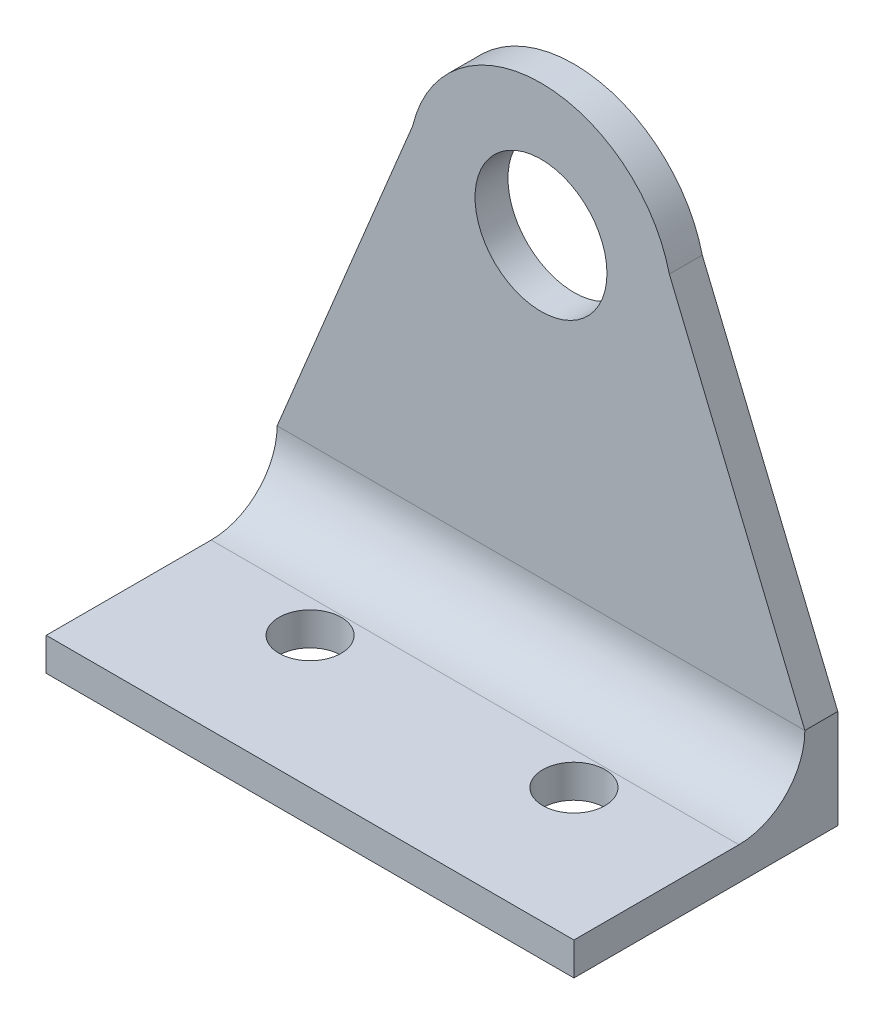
ISO-10303-21;
HEADER;
FILE_DESCRIPTION(('STEP AP214'),'2;1');
FILE_NAME('part.step','',(''),(''),'','','');
FILE_SCHEMA(('AUTOMOTIVE_DESIGN { 1 0 10303 214 1 1 1 1 }'));
ENDSEC;
DATA;
#1=APPLICATION_CONTEXT('core data for automotive mechanical design processes');
#2=APPLICATION_PROTOCOL_DEFINITION('international standard','automotive_design',2000,#1);
#3=PRODUCT_CONTEXT('',#1,'mechanical');
#4=PRODUCT('Part','Part','',(#3));
#5=PRODUCT_RELATED_PRODUCT_CATEGORY('part','',(#4));
#6=PRODUCT_DEFINITION_FORMATION('','',#4);
#7=PRODUCT_DEFINITION_CONTEXT('part definition',#1,'design');
#8=PRODUCT_DEFINITION('design','',#6,#7);
#9=PRODUCT_DEFINITION_SHAPE('','',#8);
#10=(LENGTH_UNIT() NAMED_UNIT(*) SI_UNIT(.MILLI.,.METRE.));
#11=(NAMED_UNIT(*) PLANE_ANGLE_UNIT() SI_UNIT($,.RADIAN.));
#12=(NAMED_UNIT(*) SI_UNIT($,.STERADIAN.) SOLID_ANGLE_UNIT());
#13=UNCERTAINTY_MEASURE_WITH_UNIT(LENGTH_MEASURE(1.E-05),#10,'distance_accuracy_value','');
#14=(GEOMETRIC_REPRESENTATION_CONTEXT(3) GLOBAL_UNCERTAINTY_ASSIGNED_CONTEXT((#13)) GLOBAL_UNIT_ASSIGNED_CONTEXT((#10,
#11,#12)) REPRESENTATION_CONTEXT('',''));
#15=CARTESIAN_POINT('',(0.,0.,0.));
#16=DIRECTION('',(0.,0.,1.));
#17=DIRECTION('',(1.,0.,0.));
#18=AXIS2_PLACEMENT_3D('',#15,#16,#17);
#19=CARTESIAN_POINT('',(25.4,0.,-25.4));
#20=DIRECTION('',(0.,0.,1.));
#21=DIRECTION('',(1.,0.,0.));
#22=AXIS2_PLACEMENT_3D('',#19,#20,#21);
#23=PLANE('',#22);
#24=CARTESIAN_POINT('',(0.,38.1,-25.4));
#25=DIRECTION('',(0.,0.,1.));
#26=DIRECTION('',(1.,0.,0.));
#27=AXIS2_PLACEMENT_3D('',#24,#25,#26);
#28=CIRCLE('',#27,6.35);
#29=CARTESIAN_POINT('',(6.35,38.1,-25.4));
#30=VERTEX_POINT('',#29);
#31=EDGE_CURVE('E209',#30,#30,#28,.T.);
#32=ORIENTED_EDGE('',*,*,#31,.T.);
#33=EDGE_LOOP('',(#32));
#34=FACE_BOUND('',#33,.T.);
#35=CARTESIAN_POINT('',(0.,38.1,-25.4));
#36=DIRECTION('',(0.,0.,1.));
#37=DIRECTION('',(1.,0.,0.));
#38=AXIS2_PLACEMENT_3D('',#35,#36,#37);
#39=CIRCLE('',#38,12.7);
#40=CARTESIAN_POINT('',(12.3546091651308,41.0417056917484,-25.4));
#41=VERTEX_POINT('',#40);
#42=CARTESIAN_POINT('',(-12.3546091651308,41.0417056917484,-25.4));
#43=VERTEX_POINT('',#42);
#44=EDGE_CURVE('E219',#41,#43,#39,.T.);
#45=ORIENTED_EDGE('',*,*,#44,.F.);
#46=DIRECTION('',(-0.382400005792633,0.92399688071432,0.));
#47=VECTOR('',#46,1.);
#48=CARTESIAN_POINT('',(32.4326226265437,-7.47299495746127,-25.4));
#49=LINE('',#48,#47);
#50=CARTESIAN_POINT('',(25.4,9.52,-25.4));
#51=VERTEX_POINT('',#50);
#52=EDGE_CURVE('E138',#51,#41,#49,.T.);
#53=ORIENTED_EDGE('',*,*,#52,.F.);
#54=DIRECTION('',(0.,1.,0.));
#55=VECTOR('',#54,1.);
#56=CARTESIAN_POINT('',(25.4,0.,-25.4));
#57=LINE('',#56,#55);
#58=CARTESIAN_POINT('',(25.4,0.,-25.4));
#59=VERTEX_POINT('',#58);
#60=EDGE_CURVE('E137',#59,#51,#57,.T.);
#61=ORIENTED_EDGE('',*,*,#60,.F.);
#62=DIRECTION('',(-1.,0.,0.));
#63=VECTOR('',#62,1.);
#64=CARTESIAN_POINT('',(25.4,0.,-25.4));
#65=LINE('',#64,#63);
#66=CARTESIAN_POINT('',(-25.4,0.,-25.4));
#67=VERTEX_POINT('',#66);
#68=EDGE_CURVE('E157',#59,#67,#65,.T.);
#69=ORIENTED_EDGE('',*,*,#68,.T.);
#70=DIRECTION('',(0.,1.,0.));
#71=VECTOR('',#70,1.);
#72=CARTESIAN_POINT('',(-25.4,0.,-25.4));
#73=LINE('',#72,#71);
#74=CARTESIAN_POINT('',(-25.4,9.52,-25.4));
#75=VERTEX_POINT('',#74);
#76=EDGE_CURVE('E172',#67,#75,#73,.T.);
#77=ORIENTED_EDGE('',*,*,#76,.T.);
#78=DIRECTION('',(0.382400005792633,0.92399688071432,0.));
#79=VECTOR('',#78,1.);
#80=CARTESIAN_POINT('',(-32.4326226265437,-7.47299495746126,-25.4));
#81=LINE('',#80,#79);
#82=EDGE_CURVE('E73',#75,#43,#81,.T.);
#83=ORIENTED_EDGE('',*,*,#82,.T.);
#84=EDGE_LOOP('',(#45,#53,#61,#69,#77,#83));
#85=FACE_BOUND('',#84,.T.);
#86=ADVANCED_FACE('F58',(#34,#85),#23,.F.);
#87=CARTESIAN_POINT('',(25.4,3.17,-22.23));
#88=DIRECTION('',(0.,0.,-1.));
#89=DIRECTION('',(-1.,0.,0.));
#90=AXIS2_PLACEMENT_3D('',#87,#88,#89);
#91=PLANE('',#90);
#92=CARTESIAN_POINT('',(0.,38.1,-22.23));
#93=DIRECTION('',(0.,0.,1.));
#94=DIRECTION('',(1.,0.,0.));
#95=AXIS2_PLACEMENT_3D('',#92,#93,#94);
#96=CIRCLE('',#95,6.35);
#97=CARTESIAN_POINT('',(6.35,38.1,-22.23));
#98=VERTEX_POINT('',#97);
#99=EDGE_CURVE('E210',#98,#98,#96,.T.);
#100=ORIENTED_EDGE('',*,*,#99,.F.);
#101=EDGE_LOOP('',(#100));
#102=FACE_BOUND('',#101,.T.);
#103=DIRECTION('',(-0.382400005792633,0.92399688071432,0.));
#104=VECTOR('',#103,1.);
#105=CARTESIAN_POINT('',(32.4326226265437,-7.47299495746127,-22.23));
#106=LINE('',#105,#104);
#107=CARTESIAN_POINT('',(25.4,9.52,-22.23));
#108=VERTEX_POINT('',#107);
#109=CARTESIAN_POINT('',(12.3546091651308,41.0417056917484,-22.23));
#110=VERTEX_POINT('',#109);
#111=EDGE_CURVE('E123',#108,#110,#106,.T.);
#112=ORIENTED_EDGE('',*,*,#111,.T.);
#113=CARTESIAN_POINT('',(0.,38.1,-22.23));
#114=DIRECTION('',(0.,0.,1.));
#115=DIRECTION('',(1.,0.,0.));
#116=AXIS2_PLACEMENT_3D('',#113,#114,#115);
#117=CIRCLE('',#116,12.7);
#118=CARTESIAN_POINT('',(-12.3546091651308,41.0417056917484,-22.23));
#119=VERTEX_POINT('',#118);
#120=EDGE_CURVE('E220',#110,#119,#117,.T.);
#121=ORIENTED_EDGE('',*,*,#120,.T.);
#122=DIRECTION('',(0.382400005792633,0.92399688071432,0.));
#123=VECTOR('',#122,1.);
#124=CARTESIAN_POINT('',(-32.4326226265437,-7.47299495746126,-22.23));
#125=LINE('',#124,#123);
#126=CARTESIAN_POINT('',(-25.4,9.52,-22.23));
#127=VERTEX_POINT('',#126);
#128=EDGE_CURVE('E145',#127,#119,#125,.T.);
#129=ORIENTED_EDGE('',*,*,#128,.F.);
#130=DIRECTION('',(-1.,0.,0.));
#131=VECTOR('',#130,1.);
#132=CARTESIAN_POINT('',(25.4,9.52,-22.23));
#133=LINE('',#132,#131);
#134=EDGE_CURVE('E142',#127,#108,#133,.F.);
#135=ORIENTED_EDGE('',*,*,#134,.T.);
#136=EDGE_LOOP('',(#112,#121,#129,#135));
#137=FACE_BOUND('',#136,.T.);
#138=ADVANCED_FACE('F143',(#102,#137),#91,.F.);
#139=CARTESIAN_POINT('',(25.4,0.,0.));
#140=DIRECTION('',(1.,0.,0.));
#141=DIRECTION('',(0.,0.,-1.));
#142=AXIS2_PLACEMENT_3D('',#139,#140,#141);
#143=PLANE('',#142);
#144=ORIENTED_EDGE('',*,*,#60,.T.);
#145=DIRECTION('',(0.,0.,1.));
#146=VECTOR('',#145,1.);
#147=CARTESIAN_POINT('',(25.4,9.52,-25.4));
#148=LINE('',#147,#146);
#149=EDGE_CURVE('E126',#51,#108,#148,.T.);
#150=ORIENTED_EDGE('',*,*,#149,.T.);
#151=CARTESIAN_POINT('',(25.4,9.52,-15.88));
#152=DIRECTION('',(1.,0.,0.));
#153=DIRECTION('',(0.,0.,-1.));
#154=AXIS2_PLACEMENT_3D('',#151,#152,#153);
#155=CIRCLE('',#154,6.35);
#156=CARTESIAN_POINT('',(25.4,3.17,-15.88));
#157=VERTEX_POINT('',#156);
#158=EDGE_CURVE('E12',#108,#157,#155,.F.);
#159=ORIENTED_EDGE('',*,*,#158,.T.);
#160=DIRECTION('',(0.,0.,1.));
#161=VECTOR('',#160,1.);
#162=CARTESIAN_POINT('',(25.4,3.17,0.));
#163=LINE('',#162,#161);
#164=CARTESIAN_POINT('',(25.4,3.17,0.));
#165=VERTEX_POINT('',#164);
#166=EDGE_CURVE('E182',#157,#165,#163,.T.);
#167=ORIENTED_EDGE('',*,*,#166,.T.);
#168=DIRECTION('',(0.,-1.,0.));
#169=VECTOR('',#168,1.);
#170=CARTESIAN_POINT('',(25.4,3.17,0.));
#171=LINE('',#170,#169);
#172=CARTESIAN_POINT('',(25.4,0.,0.));
#173=VERTEX_POINT('',#172);
#174=EDGE_CURVE('E171',#165,#173,#171,.T.);
#175=ORIENTED_EDGE('',*,*,#174,.T.);
#176=DIRECTION('',(0.,0.,-1.));
#177=VECTOR('',#176,1.);
#178=CARTESIAN_POINT('',(25.4,0.,0.));
#179=LINE('',#178,#177);
#180=EDGE_CURVE('E175',#173,#59,#179,.T.);
#181=ORIENTED_EDGE('',*,*,#180,.T.);
#182=EDGE_LOOP('',(#144,#150,#159,#167,#175,#181));
#183=FACE_BOUND('',#182,.T.);
#184=ADVANCED_FACE('F135',(#183),#143,.T.);
#185=CARTESIAN_POINT('',(25.4,3.17,0.));
#186=DIRECTION('',(0.,0.,-1.));
#187=DIRECTION('',(-1.,0.,0.));
#188=AXIS2_PLACEMENT_3D('',#185,#186,#187);
#189=PLANE('',#188);
#190=DIRECTION('',(0.,-1.,0.));
#191=VECTOR('',#190,1.);
#192=CARTESIAN_POINT('',(-25.4,3.17,0.));
#193=LINE('',#192,#191);
#194=CARTESIAN_POINT('',(-25.4,3.17,0.));
#195=VERTEX_POINT('',#194);
#196=CARTESIAN_POINT('',(-25.4,0.,0.));
#197=VERTEX_POINT('',#196);
#198=EDGE_CURVE('E168',#195,#197,#193,.T.);
#199=ORIENTED_EDGE('',*,*,#198,.T.);
#200=DIRECTION('',(-1.,0.,0.));
#201=VECTOR('',#200,1.);
#202=CARTESIAN_POINT('',(25.4,0.,0.));
#203=LINE('',#202,#201);
#204=EDGE_CURVE('E154',#173,#197,#203,.T.);
#205=ORIENTED_EDGE('',*,*,#204,.F.);
#206=ORIENTED_EDGE('',*,*,#174,.F.);
#207=DIRECTION('',(-1.,0.,0.));
#208=VECTOR('',#207,1.);
#209=CARTESIAN_POINT('',(25.4,3.17,0.));
#210=LINE('',#209,#208);
#211=EDGE_CURVE('E181',#165,#195,#210,.T.);
#212=ORIENTED_EDGE('',*,*,#211,.T.);
#213=EDGE_LOOP('',(#199,#205,#206,#212));
#214=FACE_BOUND('',#213,.T.);
#215=ADVANCED_FACE('F191',(#214),#189,.F.);
#216=CARTESIAN_POINT('',(25.4,0.,0.));
#217=DIRECTION('',(0.,1.,0.));
#218=DIRECTION('',(0.,0.,1.));
#219=AXIS2_PLACEMENT_3D('',#216,#217,#218);
#220=PLANE('',#219);
#221=CARTESIAN_POINT('',(-12.7,0.,-12.7));
#222=DIRECTION('',(0.,1.,0.));
#223=DIRECTION('',(0.,0.,1.));
#224=AXIS2_PLACEMENT_3D('',#221,#222,#223);
#225=CIRCLE('',#224,3.);
#226=CARTESIAN_POINT('',(-12.7,0.,-9.7));
#227=VERTEX_POINT('',#226);
#228=EDGE_CURVE('E203',#227,#227,#225,.T.);
#229=ORIENTED_EDGE('',*,*,#228,.T.);
#230=EDGE_LOOP('',(#229));
#231=FACE_BOUND('',#230,.T.);
#232=CARTESIAN_POINT('',(12.7,0.,-12.7));
#233=DIRECTION('',(0.,1.,0.));
#234=DIRECTION('',(0.,0.,1.));
#235=AXIS2_PLACEMENT_3D('',#232,#233,#234);
#236=CIRCLE('',#235,3.);
#237=CARTESIAN_POINT('',(12.7,0.,-9.7));
#238=VERTEX_POINT('',#237);
#239=EDGE_CURVE('E192',#238,#238,#236,.T.);
#240=ORIENTED_EDGE('',*,*,#239,.T.);
#241=EDGE_LOOP('',(#240));
#242=FACE_BOUND('',#241,.T.);
#243=DIRECTION('',(0.,0.,-1.));
#244=VECTOR('',#243,1.);
#245=CARTESIAN_POINT('',(-25.4,0.,0.));
#246=LINE('',#245,#244);
#247=EDGE_CURVE('E177',#197,#67,#246,.T.);
#248=ORIENTED_EDGE('',*,*,#247,.T.);
#249=ORIENTED_EDGE('',*,*,#68,.F.);
#250=ORIENTED_EDGE('',*,*,#180,.F.);
#251=ORIENTED_EDGE('',*,*,#204,.T.);
#252=EDGE_LOOP('',(#248,#249,#250,#251));
#253=FACE_BOUND('',#252,.T.);
#254=ADVANCED_FACE('F188',(#231,#242,#253),#220,.F.);
#255=CARTESIAN_POINT('',(25.4,3.17,0.));
#256=DIRECTION('',(0.,-1.,0.));
#257=DIRECTION('',(0.,0.,-1.));
#258=AXIS2_PLACEMENT_3D('',#255,#256,#257);
#259=PLANE('',#258);
#260=CARTESIAN_POINT('',(-12.7,3.17,-12.7));
#261=DIRECTION('',(0.,1.,0.));
#262=DIRECTION('',(0.,0.,1.));
#263=AXIS2_PLACEMENT_3D('',#260,#261,#262);
#264=CIRCLE('',#263,2.99999999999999);
#265=CARTESIAN_POINT('',(-12.7,3.17,-9.70000000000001));
#266=VERTEX_POINT('',#265);
#267=EDGE_CURVE('E206',#266,#266,#264,.T.);
#268=ORIENTED_EDGE('',*,*,#267,.F.);
#269=EDGE_LOOP('',(#268));
#270=FACE_BOUND('',#269,.T.);
#271=CARTESIAN_POINT('',(12.7,3.17,-12.7));
#272=DIRECTION('',(0.,1.,0.));
#273=DIRECTION('',(0.,0.,1.));
#274=AXIS2_PLACEMENT_3D('',#271,#272,#273);
#275=CIRCLE('',#274,2.99999999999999);
#276=CARTESIAN_POINT('',(12.7,3.17,-9.70000000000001));
#277=VERTEX_POINT('',#276);
#278=EDGE_CURVE('E195',#277,#277,#275,.T.);
#279=ORIENTED_EDGE('',*,*,#278,.F.);
#280=EDGE_LOOP('',(#279));
#281=FACE_BOUND('',#280,.T.);
#282=ORIENTED_EDGE('',*,*,#166,.F.);
#283=DIRECTION('',(-1.,0.,0.));
#284=VECTOR('',#283,1.);
#285=CARTESIAN_POINT('',(-25.4,3.17,-15.88));
#286=LINE('',#285,#284);
#287=CARTESIAN_POINT('',(-25.4,3.17,-15.88));
#288=VERTEX_POINT('',#287);
#289=EDGE_CURVE('E148',#157,#288,#286,.T.);
#290=ORIENTED_EDGE('',*,*,#289,.T.);
#291=DIRECTION('',(0.,0.,1.));
#292=VECTOR('',#291,1.);
#293=CARTESIAN_POINT('',(-25.4,3.17,0.));
#294=LINE('',#293,#292);
#295=EDGE_CURVE('E166',#288,#195,#294,.T.);
#296=ORIENTED_EDGE('',*,*,#295,.T.);
#297=ORIENTED_EDGE('',*,*,#211,.F.);
#298=EDGE_LOOP('',(#282,#290,#296,#297));
#299=FACE_BOUND('',#298,.T.);
#300=ADVANCED_FACE('F248',(#270,#281,#299),#259,.F.);
#301=CARTESIAN_POINT('',(-25.4,0.,0.));
#302=DIRECTION('',(1.,0.,0.));
#303=DIRECTION('',(0.,0.,-1.));
#304=AXIS2_PLACEMENT_3D('',#301,#302,#303);
#305=PLANE('',#304);
#306=CARTESIAN_POINT('',(-25.4,9.52,-15.88));
#307=DIRECTION('',(1.,0.,0.));
#308=DIRECTION('',(0.,0.,-1.));
#309=AXIS2_PLACEMENT_3D('',#306,#307,#308);
#310=CIRCLE('',#309,6.35);
#311=EDGE_CURVE('E66',#288,#127,#310,.T.);
#312=ORIENTED_EDGE('',*,*,#311,.T.);
#313=DIRECTION('',(0.,0.,1.));
#314=VECTOR('',#313,1.);
#315=CARTESIAN_POINT('',(-25.4,9.52,-25.4));
#316=LINE('',#315,#314);
#317=EDGE_CURVE('E163',#75,#127,#316,.T.);
#318=ORIENTED_EDGE('',*,*,#317,.F.);
#319=ORIENTED_EDGE('',*,*,#76,.F.);
#320=ORIENTED_EDGE('',*,*,#247,.F.);
#321=ORIENTED_EDGE('',*,*,#198,.F.);
#322=ORIENTED_EDGE('',*,*,#295,.F.);
#323=EDGE_LOOP('',(#312,#318,#319,#320,#321,#322));
#324=FACE_BOUND('',#323,.T.);
#325=ADVANCED_FACE('F161',(#324),#305,.F.);
#326=CARTESIAN_POINT('',(25.4,9.52,-15.88));
#327=DIRECTION('',(1.,0.,0.));
#328=DIRECTION('',(0.,0.,-1.));
#329=AXIS2_PLACEMENT_3D('',#326,#327,#328);
#330=CYLINDRICAL_SURFACE('',#329,6.35);
#331=ORIENTED_EDGE('',*,*,#158,.F.);
#332=ORIENTED_EDGE('',*,*,#134,.F.);
#333=ORIENTED_EDGE('',*,*,#311,.F.);
#334=ORIENTED_EDGE('',*,*,#289,.F.);
#335=EDGE_LOOP('',(#331,#332,#333,#334));
#336=FACE_BOUND('',#335,.T.);
#337=ADVANCED_FACE('F60',(#336),#330,.F.);
#338=CARTESIAN_POINT('',(12.7,3.17,-12.7));
#339=DIRECTION('',(0.,1.,0.));
#340=DIRECTION('',(0.,0.,1.));
#341=AXIS2_PLACEMENT_3D('',#338,#339,#340);
#342=CYLINDRICAL_SURFACE('',#341,2.99999999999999);
#343=ORIENTED_EDGE('',*,*,#239,.F.);
#344=EDGE_LOOP('',(#343));
#345=FACE_BOUND('',#344,.T.);
#346=ORIENTED_EDGE('',*,*,#278,.T.);
#347=EDGE_LOOP('',(#346));
#348=FACE_BOUND('',#347,.T.);
#349=ADVANCED_FACE('F259',(#345,#348),#342,.F.);
#350=CARTESIAN_POINT('',(-12.7,3.17,-12.7));
#351=DIRECTION('',(0.,1.,0.));
#352=DIRECTION('',(0.,0.,1.));
#353=AXIS2_PLACEMENT_3D('',#350,#351,#352);
#354=CYLINDRICAL_SURFACE('',#353,2.99999999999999);
#355=ORIENTED_EDGE('',*,*,#228,.F.);
#356=EDGE_LOOP('',(#355));
#357=FACE_BOUND('',#356,.T.);
#358=ORIENTED_EDGE('',*,*,#267,.T.);
#359=EDGE_LOOP('',(#358));
#360=FACE_BOUND('',#359,.T.);
#361=ADVANCED_FACE('F271',(#357,#360),#354,.F.);
#362=CARTESIAN_POINT('',(0.,38.1,-25.4));
#363=DIRECTION('',(0.,0.,1.));
#364=DIRECTION('',(1.,0.,0.));
#365=AXIS2_PLACEMENT_3D('',#362,#363,#364);
#366=CYLINDRICAL_SURFACE('',#365,6.35);
#367=CARTESIAN_POINT('',(6.35,38.1,-25.4));
#368=CARTESIAN_POINT('',(6.35,38.1,-25.3669791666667));
#369=CARTESIAN_POINT('',(6.35,38.1,-25.3339583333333));
#370=CARTESIAN_POINT('',(6.35,38.1,-25.2679166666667));
#371=CARTESIAN_POINT('',(6.35,38.1,-25.2348958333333));
#372=CARTESIAN_POINT('',(6.35,38.1,-25.1688541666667));
#373=CARTESIAN_POINT('',(6.35,38.1,-25.1358333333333));
#374=CARTESIAN_POINT('',(6.35,38.1,-25.0697916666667));
#375=CARTESIAN_POINT('',(6.35,38.1,-25.0367708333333));
#376=CARTESIAN_POINT('',(6.35,38.1,-24.9707291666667));
#377=CARTESIAN_POINT('',(6.35,38.1,-24.9377083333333));
#378=CARTESIAN_POINT('',(6.35,38.1,-24.8716666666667));
#379=CARTESIAN_POINT('',(6.35,38.1,-24.8386458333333));
#380=CARTESIAN_POINT('',(6.35,38.1,-24.7726041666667));
#381=CARTESIAN_POINT('',(6.35,38.1,-24.7395833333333));
#382=CARTESIAN_POINT('',(6.35,38.1,-24.6735416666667));
#383=CARTESIAN_POINT('',(6.35,38.1,-24.6405208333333));
#384=CARTESIAN_POINT('',(6.35,38.1,-24.5744791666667));
#385=CARTESIAN_POINT('',(6.35,38.1,-24.5414583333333));
#386=CARTESIAN_POINT('',(6.35,38.1,-24.4754166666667));
#387=CARTESIAN_POINT('',(6.35,38.1,-24.4423958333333));
#388=CARTESIAN_POINT('',(6.35,38.1,-24.3763541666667));
#389=CARTESIAN_POINT('',(6.35,38.1,-24.3433333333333));
#390=CARTESIAN_POINT('',(6.35,38.1,-24.2772916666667));
#391=CARTESIAN_POINT('',(6.35,38.1,-24.2442708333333));
#392=CARTESIAN_POINT('',(6.35,38.1,-24.1782291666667));
#393=CARTESIAN_POINT('',(6.35,38.1,-24.1452083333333));
#394=CARTESIAN_POINT('',(6.35,38.1,-24.0791666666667));
#395=CARTESIAN_POINT('',(6.35,38.1,-24.0461458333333));
#396=CARTESIAN_POINT('',(6.35,38.1,-23.9801041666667));
#397=CARTESIAN_POINT('',(6.35,38.1,-23.9470833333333));
#398=CARTESIAN_POINT('',(6.35,38.1,-23.8810416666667));
#399=CARTESIAN_POINT('',(6.35,38.1,-23.8480208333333));
#400=CARTESIAN_POINT('',(6.35,38.1,-23.7819791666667));
#401=CARTESIAN_POINT('',(6.35,38.1,-23.7489583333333));
#402=CARTESIAN_POINT('',(6.35,38.1,-23.6829166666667));
#403=CARTESIAN_POINT('',(6.35,38.1,-23.6498958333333));
#404=CARTESIAN_POINT('',(6.35,38.1,-23.5838541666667));
#405=CARTESIAN_POINT('',(6.35,38.1,-23.5508333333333));
#406=CARTESIAN_POINT('',(6.35,38.1,-23.4847916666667));
#407=CARTESIAN_POINT('',(6.35,38.1,-23.4517708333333));
#408=CARTESIAN_POINT('',(6.35,38.1,-23.3857291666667));
#409=CARTESIAN_POINT('',(6.35,38.1,-23.3527083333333));
#410=CARTESIAN_POINT('',(6.35,38.1,-23.2866666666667));
#411=CARTESIAN_POINT('',(6.35,38.1,-23.2536458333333));
#412=CARTESIAN_POINT('',(6.35,38.1,-23.1876041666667));
#413=CARTESIAN_POINT('',(6.35,38.1,-23.1545833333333));
#414=CARTESIAN_POINT('',(6.35,38.1,-23.0885416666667));
#415=CARTESIAN_POINT('',(6.35,38.1,-23.0555208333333));
#416=CARTESIAN_POINT('',(6.35,38.1,-22.9894791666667));
#417=CARTESIAN_POINT('',(6.35,38.1,-22.9564583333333));
#418=CARTESIAN_POINT('',(6.35,38.1,-22.8904166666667));
#419=CARTESIAN_POINT('',(6.35,38.1,-22.8573958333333));
#420=CARTESIAN_POINT('',(6.35,38.1,-22.7913541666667));
#421=CARTESIAN_POINT('',(6.35,38.1,-22.7583333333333));
#422=CARTESIAN_POINT('',(6.35,38.1,-22.6922916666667));
#423=CARTESIAN_POINT('',(6.35,38.1,-22.6592708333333));
#424=CARTESIAN_POINT('',(6.35,38.1,-22.5932291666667));
#425=CARTESIAN_POINT('',(6.35,38.1,-22.5602083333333));
#426=CARTESIAN_POINT('',(6.35,38.1,-22.4941666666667));
#427=CARTESIAN_POINT('',(6.35,38.1,-22.4611458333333));
#428=CARTESIAN_POINT('',(6.35,38.1,-22.3951041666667));
#429=CARTESIAN_POINT('',(6.35,38.1,-22.3620833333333));
#430=CARTESIAN_POINT('',(6.35,38.1,-22.2960416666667));
#431=CARTESIAN_POINT('',(6.35,38.1,-22.2630208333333));
#432=CARTESIAN_POINT('',(6.35,38.1,-22.23));
#433=B_SPLINE_CURVE_WITH_KNOTS('',3,(#367,#368,#369,#370,#371,#372,#373,#374,#375,#376,#377,
#378,#379,#380,#381,#382,#383,#384,#385,#386,#387,#388,#389,#390,#391,#392,#393,#394,#395,#396,
#397,#398,#399,#400,#401,#402,#403,#404,#405,#406,#407,#408,#409,#410,#411,#412,#413,#414,#415,
#416,#417,#418,#419,#420,#421,#422,#423,#424,#425,#426,#427,#428,#429,#430,#431,#432),
.UNSPECIFIED.,.F.,.F.,(4,2,2,2,2,2,2,2,2,2,2,2,2,2,2,2,2,2,2,2,2,2,2,2,2,2,2,2,2,2,2,2,4),(0.,
0.0990625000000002,0.198125,0.297187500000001,0.396250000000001,0.495312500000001,
0.594375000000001,0.693437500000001,0.792500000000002,0.891562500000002,0.990625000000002,
1.0896875,1.18875,1.2878125,1.386875,1.4859375,1.585,1.6840625,1.783125,1.8821875,1.98125,
2.0803125,2.179375,2.2784375,2.3775,2.4765625,2.575625,2.6746875,2.77375,2.8728125,2.971875,
3.0709375,3.17),.UNSPECIFIED.);
#434=EDGE_CURVE('BSEAM235',#30,#98,#433,.T.);
#435=ORIENTED_EDGE('',*,*,#31,.F.);
#436=ORIENTED_EDGE('',*,*,#99,.T.);
#437=ORIENTED_EDGE('',*,*,#434,.T.);
#438=ORIENTED_EDGE('',*,*,#434,.F.);
#439=EDGE_LOOP('',(#435,#437,#436,#438));
#440=FACE_BOUND('',#439,.T.);
#441=ADVANCED_FACE('F235',(#440),#366,.F.);
#442=CARTESIAN_POINT('',(0.,38.1,-25.4));
#443=DIRECTION('',(0.,0.,1.));
#444=DIRECTION('',(1.,0.,0.));
#445=AXIS2_PLACEMENT_3D('',#442,#443,#444);
#446=CYLINDRICAL_SURFACE('',#445,12.7);
#447=ORIENTED_EDGE('',*,*,#120,.F.);
#448=DIRECTION('',(0.,0.,1.));
#449=VECTOR('',#448,1.);
#450=CARTESIAN_POINT('',(12.3546091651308,41.0417056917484,-25.4));
#451=LINE('',#450,#449);
#452=EDGE_CURVE('E129',#41,#110,#451,.T.);
#453=ORIENTED_EDGE('',*,*,#452,.F.);
#454=ORIENTED_EDGE('',*,*,#44,.T.);
#455=DIRECTION('',(0.,0.,1.));
#456=VECTOR('',#455,1.);
#457=CARTESIAN_POINT('',(-12.3546091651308,41.0417056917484,-25.4));
#458=LINE('',#457,#456);
#459=EDGE_CURVE('E213',#43,#119,#458,.T.);
#460=ORIENTED_EDGE('',*,*,#459,.T.);
#461=EDGE_LOOP('',(#447,#453,#454,#460));
#462=FACE_BOUND('',#461,.T.);
#463=ADVANCED_FACE('F226',(#462),#446,.T.);
#464=CARTESIAN_POINT('',(-32.4326226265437,-7.47299495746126,-25.4));
#465=DIRECTION('',(0.92399688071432,-0.382400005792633,0.));
#466=DIRECTION('',(0.382400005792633,0.92399688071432,0.));
#467=AXIS2_PLACEMENT_3D('',#464,#465,#466);
#468=PLANE('',#467);
#469=ORIENTED_EDGE('',*,*,#128,.T.);
#470=ORIENTED_EDGE('',*,*,#459,.F.);
#471=ORIENTED_EDGE('',*,*,#82,.F.);
#472=ORIENTED_EDGE('',*,*,#317,.T.);
#473=EDGE_LOOP('',(#469,#470,#471,#472));
#474=FACE_BOUND('',#473,.T.);
#475=ADVANCED_FACE('F227',(#474),#468,.F.);
#476=CARTESIAN_POINT('',(32.4326226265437,-7.47299495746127,-25.4));
#477=DIRECTION('',(0.92399688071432,0.382400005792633,0.));
#478=DIRECTION('',(-0.382400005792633,0.92399688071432,0.));
#479=AXIS2_PLACEMENT_3D('',#476,#477,#478);
#480=PLANE('',#479);
#481=ORIENTED_EDGE('',*,*,#111,.F.);
#482=ORIENTED_EDGE('',*,*,#149,.F.);
#483=ORIENTED_EDGE('',*,*,#52,.T.);
#484=ORIENTED_EDGE('',*,*,#452,.T.);
#485=EDGE_LOOP('',(#481,#482,#483,#484));
#486=FACE_BOUND('',#485,.T.);
#487=ADVANCED_FACE('F124',(#486),#480,.T.);
#488=CLOSED_SHELL('',(#86,#138,#184,#215,#254,#300,#325,#337,#349,#361,#441,#463,#475,#487));
#489=MANIFOLD_SOLID_BREP('B2',#488);
#490=ADVANCED_BREP_SHAPE_REPRESENTATION('',(#18,#489),#14);
#491=SHAPE_DEFINITION_REPRESENTATION(#9,#490);
ENDSEC;
END-ISO-10303-21;
